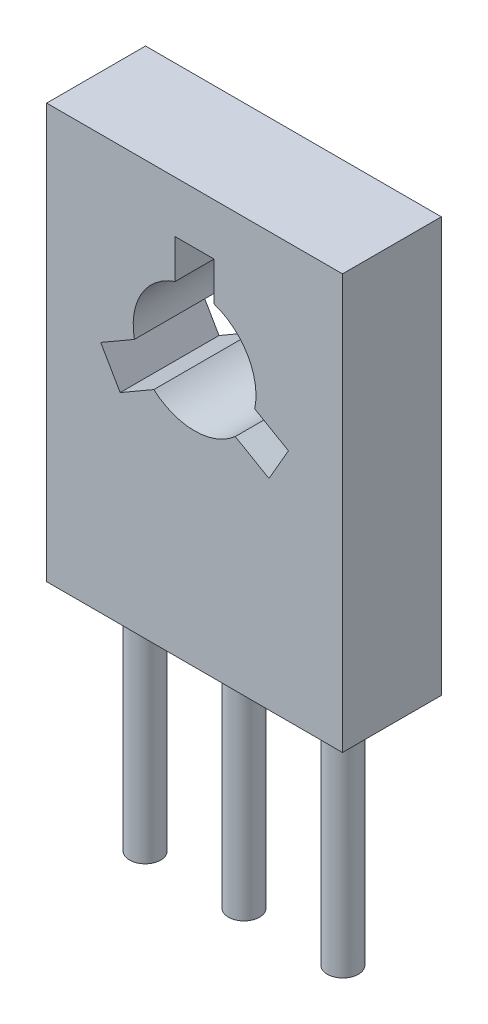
ISO-10303-21;
HEADER;
FILE_DESCRIPTION(('STEP AP214'),'2;1');
FILE_NAME('part.step','',(''),(''),'','','');
FILE_SCHEMA(('AUTOMOTIVE_DESIGN { 1 0 10303 214 1 1 1 1 }'));
ENDSEC;
DATA;
#1=APPLICATION_CONTEXT('core data for automotive mechanical design processes');
#2=APPLICATION_PROTOCOL_DEFINITION('international standard','automotive_design',2000,#1);
#3=PRODUCT_CONTEXT('',#1,'mechanical');
#4=PRODUCT('Part','Part','',(#3));
#5=PRODUCT_RELATED_PRODUCT_CATEGORY('part','',(#4));
#6=PRODUCT_DEFINITION_FORMATION('','',#4);
#7=PRODUCT_DEFINITION_CONTEXT('part definition',#1,'design');
#8=PRODUCT_DEFINITION('design','',#6,#7);
#9=PRODUCT_DEFINITION_SHAPE('','',#8);
#10=(LENGTH_UNIT() NAMED_UNIT(*) SI_UNIT(.MILLI.,.METRE.));
#11=(NAMED_UNIT(*) PLANE_ANGLE_UNIT() SI_UNIT($,.RADIAN.));
#12=(NAMED_UNIT(*) SI_UNIT($,.STERADIAN.) SOLID_ANGLE_UNIT());
#13=UNCERTAINTY_MEASURE_WITH_UNIT(LENGTH_MEASURE(1.E-05),#10,'distance_accuracy_value','');
#14=(GEOMETRIC_REPRESENTATION_CONTEXT(3) GLOBAL_UNCERTAINTY_ASSIGNED_CONTEXT((#13)) GLOBAL_UNIT_ASSIGNED_CONTEXT((#10,
#11,#12)) REPRESENTATION_CONTEXT('',''));
#15=CARTESIAN_POINT('',(0.,0.,0.));
#16=DIRECTION('',(0.,0.,1.));
#17=DIRECTION('',(1.,0.,0.));
#18=AXIS2_PLACEMENT_3D('',#15,#16,#17);
#19=CARTESIAN_POINT('',(-21.9011792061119,5.7776116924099,2.54));
#20=DIRECTION('',(0.,1.,0.));
#21=DIRECTION('',(0.,0.,1.));
#22=AXIS2_PLACEMENT_3D('',#19,#20,#21);
#23=PLANE('',#22);
#24=CARTESIAN_POINT('',(-20.6411792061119,5.7776116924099,1.27));
#25=DIRECTION('',(0.,1.,0.));
#26=DIRECTION('',(0.,0.,1.));
#27=AXIS2_PLACEMENT_3D('',#24,#25,#26);
#28=CIRCLE('',#27,0.400000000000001);
#29=CARTESIAN_POINT('',(-20.6411792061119,5.7776116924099,1.67));
#30=VERTEX_POINT('',#29);
#31=EDGE_CURVE('E35',#30,#30,#28,.F.);
#32=ORIENTED_EDGE('',*,*,#31,.F.);
#33=EDGE_LOOP('',(#32));
#34=FACE_BOUND('',#33,.T.);
#35=DIRECTION('',(1.,0.,0.));
#36=VECTOR('',#35,1.);
#37=CARTESIAN_POINT('',(-21.9011792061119,5.7776116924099,0.));
#38=LINE('',#37,#36);
#39=CARTESIAN_POINT('',(-21.9011792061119,5.7776116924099,0.));
#40=VERTEX_POINT('',#39);
#41=CARTESIAN_POINT('',(-14.3011792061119,5.7776116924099,0.));
#42=VERTEX_POINT('',#41);
#43=EDGE_CURVE('E244',#40,#42,#38,.T.);
#44=ORIENTED_EDGE('',*,*,#43,.T.);
#45=DIRECTION('',(0.,0.,-1.));
#46=VECTOR('',#45,1.);
#47=CARTESIAN_POINT('',(-14.3011792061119,5.7776116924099,2.54));
#48=LINE('',#47,#46);
#49=CARTESIAN_POINT('',(-14.3011792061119,5.7776116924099,2.54));
#50=VERTEX_POINT('',#49);
#51=EDGE_CURVE('E265',#50,#42,#48,.T.);
#52=ORIENTED_EDGE('',*,*,#51,.F.);
#53=DIRECTION('',(1.,0.,0.));
#54=VECTOR('',#53,1.);
#55=CARTESIAN_POINT('',(-21.9011792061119,5.7776116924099,2.54));
#56=LINE('',#55,#54);
#57=CARTESIAN_POINT('',(-21.9011792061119,5.7776116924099,2.54));
#58=VERTEX_POINT('',#57);
#59=EDGE_CURVE('E253',#58,#50,#56,.T.);
#60=ORIENTED_EDGE('',*,*,#59,.F.);
#61=DIRECTION('',(0.,0.,-1.));
#62=VECTOR('',#61,1.);
#63=CARTESIAN_POINT('',(-21.9011792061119,5.7776116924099,2.54));
#64=LINE('',#63,#62);
#65=EDGE_CURVE('E268',#58,#40,#64,.T.);
#66=ORIENTED_EDGE('',*,*,#65,.T.);
#67=EDGE_LOOP('',(#44,#52,#60,#66));
#68=FACE_BOUND('',#67,.T.);
#69=CARTESIAN_POINT('',(-18.1011792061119,5.7776116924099,1.27));
#70=DIRECTION('',(0.,1.,0.));
#71=DIRECTION('',(0.,0.,1.));
#72=AXIS2_PLACEMENT_3D('',#69,#70,#71);
#73=CIRCLE('',#72,0.400000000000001);
#74=CARTESIAN_POINT('',(-18.1011792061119,5.7776116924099,1.67));
#75=VERTEX_POINT('',#74);
#76=EDGE_CURVE('E271',#75,#75,#73,.F.);
#77=ORIENTED_EDGE('',*,*,#76,.F.);
#78=EDGE_LOOP('',(#77));
#79=FACE_BOUND('',#78,.T.);
#80=CARTESIAN_POINT('',(-15.5611792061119,5.7776116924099,1.27));
#81=DIRECTION('',(0.,1.,0.));
#82=DIRECTION('',(0.,0.,1.));
#83=AXIS2_PLACEMENT_3D('',#80,#81,#82);
#84=CIRCLE('',#83,0.399999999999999);
#85=CARTESIAN_POINT('',(-15.5611792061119,5.7776116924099,1.67));
#86=VERTEX_POINT('',#85);
#87=EDGE_CURVE('E11',#86,#86,#84,.F.);
#88=ORIENTED_EDGE('',*,*,#87,.F.);
#89=EDGE_LOOP('',(#88));
#90=FACE_BOUND('',#89,.T.);
#91=ADVANCED_FACE('F27',(#34,#68,#79,#90),#23,.F.);
#92=CARTESIAN_POINT('',(-21.9011792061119,5.7776116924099,2.54));
#93=DIRECTION('',(1.,0.,0.));
#94=DIRECTION('',(0.,0.,-1.));
#95=AXIS2_PLACEMENT_3D('',#92,#93,#94);
#96=PLANE('',#95);
#97=DIRECTION('',(0.,-1.,0.));
#98=VECTOR('',#97,1.);
#99=CARTESIAN_POINT('',(-21.9011792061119,5.7776116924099,0.));
#100=LINE('',#99,#98);
#101=CARTESIAN_POINT('',(-21.9011792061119,16.4276116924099,0.));
#102=VERTEX_POINT('',#101);
#103=EDGE_CURVE('E223',#102,#40,#100,.T.);
#104=ORIENTED_EDGE('',*,*,#103,.T.);
#105=ORIENTED_EDGE('',*,*,#65,.F.);
#106=DIRECTION('',(0.,-1.,0.));
#107=VECTOR('',#106,1.);
#108=CARTESIAN_POINT('',(-21.9011792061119,5.7776116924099,2.54));
#109=LINE('',#108,#107);
#110=CARTESIAN_POINT('',(-21.9011792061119,16.4276116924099,2.54));
#111=VERTEX_POINT('',#110);
#112=EDGE_CURVE('E250',#111,#58,#109,.T.);
#113=ORIENTED_EDGE('',*,*,#112,.F.);
#114=DIRECTION('',(0.,0.,-1.));
#115=VECTOR('',#114,1.);
#116=CARTESIAN_POINT('',(-21.9011792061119,16.4276116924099,2.54));
#117=LINE('',#116,#115);
#118=EDGE_CURVE('E259',#111,#102,#117,.T.);
#119=ORIENTED_EDGE('',*,*,#118,.T.);
#120=EDGE_LOOP('',(#104,#105,#113,#119));
#121=FACE_BOUND('',#120,.T.);
#122=ADVANCED_FACE('F29',(#121),#96,.F.);
#123=CARTESIAN_POINT('',(-14.3011792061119,5.7776116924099,2.54));
#124=DIRECTION('',(-1.,0.,0.));
#125=DIRECTION('',(0.,0.,1.));
#126=AXIS2_PLACEMENT_3D('',#123,#124,#125);
#127=PLANE('',#126);
#128=DIRECTION('',(0.,1.,0.));
#129=VECTOR('',#128,1.);
#130=CARTESIAN_POINT('',(-14.3011792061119,5.7776116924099,0.));
#131=LINE('',#130,#129);
#132=CARTESIAN_POINT('',(-14.3011792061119,16.4276116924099,0.));
#133=VERTEX_POINT('',#132);
#134=EDGE_CURVE('E246',#42,#133,#131,.T.);
#135=ORIENTED_EDGE('',*,*,#134,.T.);
#136=DIRECTION('',(0.,0.,-1.));
#137=VECTOR('',#136,1.);
#138=CARTESIAN_POINT('',(-14.3011792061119,16.4276116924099,2.54));
#139=LINE('',#138,#137);
#140=CARTESIAN_POINT('',(-14.3011792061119,16.4276116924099,2.54));
#141=VERTEX_POINT('',#140);
#142=EDGE_CURVE('E262',#141,#133,#139,.T.);
#143=ORIENTED_EDGE('',*,*,#142,.F.);
#144=DIRECTION('',(0.,1.,0.));
#145=VECTOR('',#144,1.);
#146=CARTESIAN_POINT('',(-14.3011792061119,5.7776116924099,2.54));
#147=LINE('',#146,#145);
#148=EDGE_CURVE('E255',#50,#141,#147,.T.);
#149=ORIENTED_EDGE('',*,*,#148,.F.);
#150=ORIENTED_EDGE('',*,*,#51,.T.);
#151=EDGE_LOOP('',(#135,#143,#149,#150));
#152=FACE_BOUND('',#151,.T.);
#153=ADVANCED_FACE('F365',(#152),#127,.F.);
#154=CARTESIAN_POINT('',(-21.9011792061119,16.4276116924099,2.54));
#155=DIRECTION('',(0.,-1.,0.));
#156=DIRECTION('',(0.,0.,-1.));
#157=AXIS2_PLACEMENT_3D('',#154,#155,#156);
#158=PLANE('',#157);
#159=DIRECTION('',(-1.,0.,0.));
#160=VECTOR('',#159,1.);
#161=CARTESIAN_POINT('',(-21.9011792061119,16.4276116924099,0.));
#162=LINE('',#161,#160);
#163=EDGE_CURVE('E248',#133,#102,#162,.T.);
#164=ORIENTED_EDGE('',*,*,#163,.T.);
#165=ORIENTED_EDGE('',*,*,#118,.F.);
#166=DIRECTION('',(-1.,0.,0.));
#167=VECTOR('',#166,1.);
#168=CARTESIAN_POINT('',(-21.9011792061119,16.4276116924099,2.54));
#169=LINE('',#168,#167);
#170=EDGE_CURVE('E257',#141,#111,#169,.T.);
#171=ORIENTED_EDGE('',*,*,#170,.F.);
#172=ORIENTED_EDGE('',*,*,#142,.T.);
#173=EDGE_LOOP('',(#164,#165,#171,#172));
#174=FACE_BOUND('',#173,.T.);
#175=ADVANCED_FACE('F362',(#174),#158,.F.);
#176=CARTESIAN_POINT('',(-21.9011792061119,16.4276116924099,2.54));
#177=DIRECTION('',(0.,0.,-1.));
#178=DIRECTION('',(-1.,0.,0.));
#179=AXIS2_PLACEMENT_3D('',#176,#177,#178);
#180=PLANE('',#179);
#181=DIRECTION('',(0.866025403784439,-0.499999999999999,0.));
#182=VECTOR('',#181,1.);
#183=CARTESIAN_POINT('',(-16.1894740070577,10.930284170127,2.54));
#184=LINE('',#183,#182);
#185=CARTESIAN_POINT('',(-17.0554994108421,11.430284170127,2.54));
#186=VERTEX_POINT('',#185);
#187=CARTESIAN_POINT('',(-16.1894740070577,10.930284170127,2.54));
#188=VERTEX_POINT('',#187);
#189=EDGE_CURVE('E151',#186,#188,#184,.T.);
#190=ORIENTED_EDGE('',*,*,#189,.F.);
#191=CARTESIAN_POINT('',(-18.1011792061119,12.6113579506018,2.54));
#192=DIRECTION('',(0.,0.,1.));
#193=DIRECTION('',(1.,0.,0.));
#194=AXIS2_PLACEMENT_3D('',#191,#192,#193);
#195=CIRCLE('',#194,1.57746046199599);
#196=CARTESIAN_POINT('',(-19.1468590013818,11.430284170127,2.54));
#197=VERTEX_POINT('',#196);
#198=EDGE_CURVE('E42',#197,#186,#195,.T.);
#199=ORIENTED_EDGE('',*,*,#198,.F.);
#200=DIRECTION('',(0.866025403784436,0.500000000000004,0.));
#201=VECTOR('',#200,1.);
#202=CARTESIAN_POINT('',(-20.0128844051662,10.930284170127,2.54));
#203=LINE('',#202,#201);
#204=CARTESIAN_POINT('',(-20.0128844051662,10.930284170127,2.54));
#205=VERTEX_POINT('',#204);
#206=EDGE_CURVE('E185',#205,#197,#203,.T.);
#207=ORIENTED_EDGE('',*,*,#206,.F.);
#208=DIRECTION('',(0.500000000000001,-0.866025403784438,0.));
#209=VECTOR('',#208,1.);
#210=CARTESIAN_POINT('',(-20.5128844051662,11.7963095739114,2.54));
#211=LINE('',#210,#209);
#212=CARTESIAN_POINT('',(-20.5128844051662,11.7963095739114,2.54));
#213=VERTEX_POINT('',#212);
#214=EDGE_CURVE('E182',#213,#205,#211,.T.);
#215=ORIENTED_EDGE('',*,*,#214,.F.);
#216=DIRECTION('',(-0.866025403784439,-0.5,0.));
#217=VECTOR('',#216,1.);
#218=CARTESIAN_POINT('',(-20.5128844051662,11.7963095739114,2.54));
#219=LINE('',#218,#217);
#220=CARTESIAN_POINT('',(-19.6468590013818,12.2963095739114,2.54));
#221=VERTEX_POINT('',#220);
#222=EDGE_CURVE('E179',#221,#213,#219,.T.);
#223=ORIENTED_EDGE('',*,*,#222,.F.);
#224=CARTESIAN_POINT('',(-18.1011792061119,12.6113579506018,2.54));
#225=DIRECTION('',(0.,0.,1.));
#226=DIRECTION('',(1.,0.,0.));
#227=AXIS2_PLACEMENT_3D('',#224,#225,#226);
#228=CIRCLE('',#227,1.57746046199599);
#229=CARTESIAN_POINT('',(-18.6011792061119,14.107480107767,2.54));
#230=VERTEX_POINT('',#229);
#231=EDGE_CURVE('E176',#230,#221,#228,.T.);
#232=ORIENTED_EDGE('',*,*,#231,.F.);
#233=DIRECTION('',(0.,-1.,0.));
#234=VECTOR('',#233,1.);
#235=CARTESIAN_POINT('',(-18.6011792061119,15.107480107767,2.54));
#236=LINE('',#235,#234);
#237=CARTESIAN_POINT('',(-18.6011792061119,15.107480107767,2.54));
#238=VERTEX_POINT('',#237);
#239=EDGE_CURVE('E173',#238,#230,#236,.T.);
#240=ORIENTED_EDGE('',*,*,#239,.F.);
#241=DIRECTION('',(-1.,0.,0.));
#242=VECTOR('',#241,1.);
#243=CARTESIAN_POINT('',(-18.6011792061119,15.107480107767,2.54));
#244=LINE('',#243,#242);
#245=CARTESIAN_POINT('',(-17.6011792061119,15.107480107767,2.54));
#246=VERTEX_POINT('',#245);
#247=EDGE_CURVE('E170',#246,#238,#244,.T.);
#248=ORIENTED_EDGE('',*,*,#247,.F.);
#249=DIRECTION('',(0.,1.,0.));
#250=VECTOR('',#249,1.);
#251=CARTESIAN_POINT('',(-17.6011792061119,15.107480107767,2.54));
#252=LINE('',#251,#250);
#253=CARTESIAN_POINT('',(-17.6011792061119,14.107480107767,2.54));
#254=VERTEX_POINT('',#253);
#255=EDGE_CURVE('E167',#254,#246,#252,.T.);
#256=ORIENTED_EDGE('',*,*,#255,.F.);
#257=CARTESIAN_POINT('',(-18.1011792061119,12.6113579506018,2.54));
#258=DIRECTION('',(0.,0.,1.));
#259=DIRECTION('',(-1.,0.,0.));
#260=AXIS2_PLACEMENT_3D('',#257,#258,#259);
#261=CIRCLE('',#260,1.57746046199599);
#262=CARTESIAN_POINT('',(-16.5554994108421,12.2963095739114,2.54));
#263=VERTEX_POINT('',#262);
#264=EDGE_CURVE('E161',#263,#254,#261,.T.);
#265=ORIENTED_EDGE('',*,*,#264,.F.);
#266=DIRECTION('',(-0.866025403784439,0.499999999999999,0.));
#267=VECTOR('',#266,1.);
#268=CARTESIAN_POINT('',(-15.6894740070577,11.7963095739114,2.54));
#269=LINE('',#268,#267);
#270=CARTESIAN_POINT('',(-15.6894740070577,11.7963095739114,2.54));
#271=VERTEX_POINT('',#270);
#272=EDGE_CURVE('E159',#271,#263,#269,.T.);
#273=ORIENTED_EDGE('',*,*,#272,.F.);
#274=DIRECTION('',(0.499999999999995,0.866025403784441,0.));
#275=VECTOR('',#274,1.);
#276=CARTESIAN_POINT('',(-16.1894740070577,10.930284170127,2.54));
#277=LINE('',#276,#275);
#278=EDGE_CURVE('E142',#188,#271,#277,.T.);
#279=ORIENTED_EDGE('',*,*,#278,.F.);
#280=EDGE_LOOP('',(#190,#199,#207,#215,#223,#232,#240,#248,#256,#265,#273,#279));
#281=FACE_BOUND('',#280,.T.);
#282=ORIENTED_EDGE('',*,*,#112,.T.);
#283=ORIENTED_EDGE('',*,*,#59,.T.);
#284=ORIENTED_EDGE('',*,*,#148,.T.);
#285=ORIENTED_EDGE('',*,*,#170,.T.);
#286=EDGE_LOOP('',(#282,#283,#284,#285));
#287=FACE_BOUND('',#286,.T.);
#288=ADVANCED_FACE('F155',(#281,#287),#180,.F.);
#289=CARTESIAN_POINT('',(-21.9011792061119,16.4276116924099,0.));
#290=DIRECTION('',(0.,0.,-1.));
#291=DIRECTION('',(-1.,0.,0.));
#292=AXIS2_PLACEMENT_3D('',#289,#290,#291);
#293=PLANE('',#292);
#294=CARTESIAN_POINT('',(-18.1011792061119,12.6113579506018,0.));
#295=DIRECTION('',(0.,0.,1.));
#296=DIRECTION('',(1.,0.,0.));
#297=AXIS2_PLACEMENT_3D('',#294,#295,#296);
#298=CIRCLE('',#297,1.57746046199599);
#299=CARTESIAN_POINT('',(-19.1468590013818,11.430284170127,0.));
#300=VERTEX_POINT('',#299);
#301=CARTESIAN_POINT('',(-17.0554994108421,11.430284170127,0.));
#302=VERTEX_POINT('',#301);
#303=EDGE_CURVE('E188',#300,#302,#298,.T.);
#304=ORIENTED_EDGE('',*,*,#303,.T.);
#305=DIRECTION('',(0.866025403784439,-0.499999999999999,0.));
#306=VECTOR('',#305,1.);
#307=CARTESIAN_POINT('',(-16.1894740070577,10.930284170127,0.));
#308=LINE('',#307,#306);
#309=CARTESIAN_POINT('',(-16.1894740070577,10.930284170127,0.));
#310=VERTEX_POINT('',#309);
#311=EDGE_CURVE('E191',#302,#310,#308,.T.);
#312=ORIENTED_EDGE('',*,*,#311,.T.);
#313=DIRECTION('',(0.499999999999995,0.866025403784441,0.));
#314=VECTOR('',#313,1.);
#315=CARTESIAN_POINT('',(-16.1894740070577,10.930284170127,0.));
#316=LINE('',#315,#314);
#317=CARTESIAN_POINT('',(-15.6894740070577,11.7963095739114,0.));
#318=VERTEX_POINT('',#317);
#319=EDGE_CURVE('E50',#310,#318,#316,.T.);
#320=ORIENTED_EDGE('',*,*,#319,.T.);
#321=DIRECTION('',(-0.866025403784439,0.499999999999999,0.));
#322=VECTOR('',#321,1.);
#323=CARTESIAN_POINT('',(-15.6894740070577,11.7963095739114,0.));
#324=LINE('',#323,#322);
#325=CARTESIAN_POINT('',(-16.5554994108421,12.2963095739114,0.));
#326=VERTEX_POINT('',#325);
#327=EDGE_CURVE('E194',#318,#326,#324,.T.);
#328=ORIENTED_EDGE('',*,*,#327,.T.);
#329=CARTESIAN_POINT('',(-18.1011792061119,12.6113579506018,0.));
#330=DIRECTION('',(0.,0.,1.));
#331=DIRECTION('',(-1.,0.,0.));
#332=AXIS2_PLACEMENT_3D('',#329,#330,#331);
#333=CIRCLE('',#332,1.57746046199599);
#334=CARTESIAN_POINT('',(-17.6011792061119,14.107480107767,0.));
#335=VERTEX_POINT('',#334);
#336=EDGE_CURVE('E197',#326,#335,#333,.T.);
#337=ORIENTED_EDGE('',*,*,#336,.T.);
#338=DIRECTION('',(0.,1.,0.));
#339=VECTOR('',#338,1.);
#340=CARTESIAN_POINT('',(-17.6011792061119,15.107480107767,0.));
#341=LINE('',#340,#339);
#342=CARTESIAN_POINT('',(-17.6011792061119,15.107480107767,0.));
#343=VERTEX_POINT('',#342);
#344=EDGE_CURVE('E200',#335,#343,#341,.T.);
#345=ORIENTED_EDGE('',*,*,#344,.T.);
#346=DIRECTION('',(-1.,0.,0.));
#347=VECTOR('',#346,1.);
#348=CARTESIAN_POINT('',(-18.6011792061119,15.107480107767,0.));
#349=LINE('',#348,#347);
#350=CARTESIAN_POINT('',(-18.6011792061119,15.107480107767,0.));
#351=VERTEX_POINT('',#350);
#352=EDGE_CURVE('E203',#343,#351,#349,.T.);
#353=ORIENTED_EDGE('',*,*,#352,.T.);
#354=DIRECTION('',(0.,-1.,0.));
#355=VECTOR('',#354,1.);
#356=CARTESIAN_POINT('',(-18.6011792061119,15.107480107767,0.));
#357=LINE('',#356,#355);
#358=CARTESIAN_POINT('',(-18.6011792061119,14.107480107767,0.));
#359=VERTEX_POINT('',#358);
#360=EDGE_CURVE('E206',#351,#359,#357,.T.);
#361=ORIENTED_EDGE('',*,*,#360,.T.);
#362=CARTESIAN_POINT('',(-18.1011792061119,12.6113579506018,0.));
#363=DIRECTION('',(0.,0.,1.));
#364=DIRECTION('',(1.,0.,0.));
#365=AXIS2_PLACEMENT_3D('',#362,#363,#364);
#366=CIRCLE('',#365,1.57746046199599);
#367=CARTESIAN_POINT('',(-19.6468590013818,12.2963095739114,0.));
#368=VERTEX_POINT('',#367);
#369=EDGE_CURVE('E209',#359,#368,#366,.T.);
#370=ORIENTED_EDGE('',*,*,#369,.T.);
#371=DIRECTION('',(-0.866025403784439,-0.5,0.));
#372=VECTOR('',#371,1.);
#373=CARTESIAN_POINT('',(-20.5128844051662,11.7963095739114,0.));
#374=LINE('',#373,#372);
#375=CARTESIAN_POINT('',(-20.5128844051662,11.7963095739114,0.));
#376=VERTEX_POINT('',#375);
#377=EDGE_CURVE('E212',#368,#376,#374,.T.);
#378=ORIENTED_EDGE('',*,*,#377,.T.);
#379=DIRECTION('',(0.500000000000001,-0.866025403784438,0.));
#380=VECTOR('',#379,1.);
#381=CARTESIAN_POINT('',(-20.5128844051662,11.7963095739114,0.));
#382=LINE('',#381,#380);
#383=CARTESIAN_POINT('',(-20.0128844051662,10.930284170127,0.));
#384=VERTEX_POINT('',#383);
#385=EDGE_CURVE('E215',#376,#384,#382,.T.);
#386=ORIENTED_EDGE('',*,*,#385,.T.);
#387=DIRECTION('',(0.866025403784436,0.500000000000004,0.));
#388=VECTOR('',#387,1.);
#389=CARTESIAN_POINT('',(-20.0128844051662,10.930284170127,0.));
#390=LINE('',#389,#388);
#391=EDGE_CURVE('E218',#384,#300,#390,.T.);
#392=ORIENTED_EDGE('',*,*,#391,.T.);
#393=EDGE_LOOP('',(#304,#312,#320,#328,#337,#345,#353,#361,#370,#378,#386,#392));
#394=FACE_BOUND('',#393,.T.);
#395=ORIENTED_EDGE('',*,*,#103,.F.);
#396=ORIENTED_EDGE('',*,*,#163,.F.);
#397=ORIENTED_EDGE('',*,*,#134,.F.);
#398=ORIENTED_EDGE('',*,*,#43,.F.);
#399=EDGE_LOOP('',(#395,#396,#397,#398));
#400=FACE_BOUND('',#399,.T.);
#401=ADVANCED_FACE('F356',(#394,#400),#293,.T.);
#402=CARTESIAN_POINT('',(-18.1011792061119,12.6113579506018,0.));
#403=DIRECTION('',(0.,0.,1.));
#404=DIRECTION('',(1.,0.,0.));
#405=AXIS2_PLACEMENT_3D('',#402,#403,#404);
#406=CYLINDRICAL_SURFACE('',#405,1.57746046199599);
#407=ORIENTED_EDGE('',*,*,#198,.T.);
#408=DIRECTION('',(0.,0.,1.));
#409=VECTOR('',#408,1.);
#410=CARTESIAN_POINT('',(-17.0554994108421,11.430284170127,0.));
#411=LINE('',#410,#409);
#412=EDGE_CURVE('E148',#302,#186,#411,.T.);
#413=ORIENTED_EDGE('',*,*,#412,.F.);
#414=ORIENTED_EDGE('',*,*,#303,.F.);
#415=DIRECTION('',(0.,0.,1.));
#416=VECTOR('',#415,1.);
#417=CARTESIAN_POINT('',(-19.1468590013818,11.430284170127,0.));
#418=LINE('',#417,#416);
#419=EDGE_CURVE('E221',#300,#197,#418,.T.);
#420=ORIENTED_EDGE('',*,*,#419,.T.);
#421=EDGE_LOOP('',(#407,#413,#414,#420));
#422=FACE_BOUND('',#421,.T.);
#423=ADVANCED_FACE('F317',(#422),#406,.F.);
#424=CARTESIAN_POINT('',(-20.0128844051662,10.930284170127,0.));
#425=DIRECTION('',(0.500000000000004,-0.866025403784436,0.));
#426=DIRECTION('',(0.866025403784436,0.500000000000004,0.));
#427=AXIS2_PLACEMENT_3D('',#424,#425,#426);
#428=PLANE('',#427);
#429=ORIENTED_EDGE('',*,*,#206,.T.);
#430=ORIENTED_EDGE('',*,*,#419,.F.);
#431=ORIENTED_EDGE('',*,*,#391,.F.);
#432=DIRECTION('',(0.,0.,1.));
#433=VECTOR('',#432,1.);
#434=CARTESIAN_POINT('',(-20.0128844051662,10.930284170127,0.));
#435=LINE('',#434,#433);
#436=EDGE_CURVE('E224',#384,#205,#435,.T.);
#437=ORIENTED_EDGE('',*,*,#436,.T.);
#438=EDGE_LOOP('',(#429,#430,#431,#437));
#439=FACE_BOUND('',#438,.T.);
#440=ADVANCED_FACE('F313',(#439),#428,.F.);
#441=CARTESIAN_POINT('',(-20.5128844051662,11.7963095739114,0.));
#442=DIRECTION('',(-0.866025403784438,-0.500000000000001,0.));
#443=DIRECTION('',(0.500000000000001,-0.866025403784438,0.));
#444=AXIS2_PLACEMENT_3D('',#441,#442,#443);
#445=PLANE('',#444);
#446=ORIENTED_EDGE('',*,*,#214,.T.);
#447=ORIENTED_EDGE('',*,*,#436,.F.);
#448=ORIENTED_EDGE('',*,*,#385,.F.);
#449=DIRECTION('',(0.,0.,1.));
#450=VECTOR('',#449,1.);
#451=CARTESIAN_POINT('',(-20.5128844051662,11.7963095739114,0.));
#452=LINE('',#451,#450);
#453=EDGE_CURVE('E226',#376,#213,#452,.T.);
#454=ORIENTED_EDGE('',*,*,#453,.T.);
#455=EDGE_LOOP('',(#446,#447,#448,#454));
#456=FACE_BOUND('',#455,.T.);
#457=ADVANCED_FACE('F316',(#456),#445,.F.);
#458=CARTESIAN_POINT('',(-20.5128844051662,11.7963095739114,0.));
#459=DIRECTION('',(-0.5,0.866025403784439,0.));
#460=DIRECTION('',(-0.866025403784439,-0.5,0.));
#461=AXIS2_PLACEMENT_3D('',#458,#459,#460);
#462=PLANE('',#461);
#463=ORIENTED_EDGE('',*,*,#222,.T.);
#464=ORIENTED_EDGE('',*,*,#453,.F.);
#465=ORIENTED_EDGE('',*,*,#377,.F.);
#466=DIRECTION('',(0.,0.,1.));
#467=VECTOR('',#466,1.);
#468=CARTESIAN_POINT('',(-19.6468590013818,12.2963095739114,0.));
#469=LINE('',#468,#467);
#470=EDGE_CURVE('E228',#368,#221,#469,.T.);
#471=ORIENTED_EDGE('',*,*,#470,.T.);
#472=EDGE_LOOP('',(#463,#464,#465,#471));
#473=FACE_BOUND('',#472,.T.);
#474=ADVANCED_FACE('F321',(#473),#462,.F.);
#475=CARTESIAN_POINT('',(-18.1011792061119,12.6113579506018,0.));
#476=DIRECTION('',(0.,0.,1.));
#477=DIRECTION('',(1.,0.,0.));
#478=AXIS2_PLACEMENT_3D('',#475,#476,#477);
#479=CYLINDRICAL_SURFACE('',#478,1.57746046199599);
#480=ORIENTED_EDGE('',*,*,#231,.T.);
#481=ORIENTED_EDGE('',*,*,#470,.F.);
#482=ORIENTED_EDGE('',*,*,#369,.F.);
#483=DIRECTION('',(0.,0.,1.));
#484=VECTOR('',#483,1.);
#485=CARTESIAN_POINT('',(-18.6011792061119,14.107480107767,0.));
#486=LINE('',#485,#484);
#487=EDGE_CURVE('E230',#359,#230,#486,.T.);
#488=ORIENTED_EDGE('',*,*,#487,.T.);
#489=EDGE_LOOP('',(#480,#481,#482,#488));
#490=FACE_BOUND('',#489,.T.);
#491=ADVANCED_FACE('F325',(#490),#479,.F.);
#492=CARTESIAN_POINT('',(-18.6011792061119,15.107480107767,0.));
#493=DIRECTION('',(-1.,0.,0.));
#494=DIRECTION('',(0.,-1.,0.));
#495=AXIS2_PLACEMENT_3D('',#492,#493,#494);
#496=PLANE('',#495);
#497=ORIENTED_EDGE('',*,*,#239,.T.);
#498=ORIENTED_EDGE('',*,*,#487,.F.);
#499=ORIENTED_EDGE('',*,*,#360,.F.);
#500=DIRECTION('',(0.,0.,1.));
#501=VECTOR('',#500,1.);
#502=CARTESIAN_POINT('',(-18.6011792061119,15.107480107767,0.));
#503=LINE('',#502,#501);
#504=EDGE_CURVE('E232',#351,#238,#503,.T.);
#505=ORIENTED_EDGE('',*,*,#504,.T.);
#506=EDGE_LOOP('',(#497,#498,#499,#505));
#507=FACE_BOUND('',#506,.T.);
#508=ADVANCED_FACE('F329',(#507),#496,.F.);
#509=CARTESIAN_POINT('',(-18.6011792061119,15.107480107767,0.));
#510=DIRECTION('',(0.,1.,0.));
#511=DIRECTION('',(0.,0.,1.));
#512=AXIS2_PLACEMENT_3D('',#509,#510,#511);
#513=PLANE('',#512);
#514=ORIENTED_EDGE('',*,*,#247,.T.);
#515=ORIENTED_EDGE('',*,*,#504,.F.);
#516=ORIENTED_EDGE('',*,*,#352,.F.);
#517=DIRECTION('',(0.,0.,1.));
#518=VECTOR('',#517,1.);
#519=CARTESIAN_POINT('',(-17.6011792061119,15.107480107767,0.));
#520=LINE('',#519,#518);
#521=EDGE_CURVE('E234',#343,#246,#520,.T.);
#522=ORIENTED_EDGE('',*,*,#521,.T.);
#523=EDGE_LOOP('',(#514,#515,#516,#522));
#524=FACE_BOUND('',#523,.T.);
#525=ADVANCED_FACE('F333',(#524),#513,.F.);
#526=CARTESIAN_POINT('',(-17.6011792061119,15.107480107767,0.));
#527=DIRECTION('',(1.,0.,0.));
#528=DIRECTION('',(0.,1.,0.));
#529=AXIS2_PLACEMENT_3D('',#526,#527,#528);
#530=PLANE('',#529);
#531=ORIENTED_EDGE('',*,*,#255,.T.);
#532=ORIENTED_EDGE('',*,*,#521,.F.);
#533=ORIENTED_EDGE('',*,*,#344,.F.);
#534=DIRECTION('',(0.,0.,1.));
#535=VECTOR('',#534,1.);
#536=CARTESIAN_POINT('',(-17.6011792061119,14.107480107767,0.));
#537=LINE('',#536,#535);
#538=EDGE_CURVE('E236',#335,#254,#537,.T.);
#539=ORIENTED_EDGE('',*,*,#538,.T.);
#540=EDGE_LOOP('',(#531,#532,#533,#539));
#541=FACE_BOUND('',#540,.T.);
#542=ADVANCED_FACE('F337',(#541),#530,.F.);
#543=CARTESIAN_POINT('',(-18.1011792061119,12.6113579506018,0.));
#544=DIRECTION('',(0.,0.,1.));
#545=DIRECTION('',(1.,0.,0.));
#546=AXIS2_PLACEMENT_3D('',#543,#544,#545);
#547=CYLINDRICAL_SURFACE('',#546,1.57746046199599);
#548=ORIENTED_EDGE('',*,*,#264,.T.);
#549=ORIENTED_EDGE('',*,*,#538,.F.);
#550=ORIENTED_EDGE('',*,*,#336,.F.);
#551=DIRECTION('',(0.,0.,1.));
#552=VECTOR('',#551,1.);
#553=CARTESIAN_POINT('',(-16.5554994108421,12.2963095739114,0.));
#554=LINE('',#553,#552);
#555=EDGE_CURVE('E238',#326,#263,#554,.T.);
#556=ORIENTED_EDGE('',*,*,#555,.T.);
#557=EDGE_LOOP('',(#548,#549,#550,#556));
#558=FACE_BOUND('',#557,.T.);
#559=ADVANCED_FACE('F341',(#558),#547,.F.);
#560=CARTESIAN_POINT('',(-15.6894740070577,11.7963095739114,0.));
#561=DIRECTION('',(0.499999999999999,0.866025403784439,0.));
#562=DIRECTION('',(-0.866025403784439,0.499999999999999,0.));
#563=AXIS2_PLACEMENT_3D('',#560,#561,#562);
#564=PLANE('',#563);
#565=ORIENTED_EDGE('',*,*,#272,.T.);
#566=ORIENTED_EDGE('',*,*,#555,.F.);
#567=ORIENTED_EDGE('',*,*,#327,.F.);
#568=DIRECTION('',(0.,0.,1.));
#569=VECTOR('',#568,1.);
#570=CARTESIAN_POINT('',(-15.6894740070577,11.7963095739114,0.));
#571=LINE('',#570,#569);
#572=EDGE_CURVE('E147',#318,#271,#571,.T.);
#573=ORIENTED_EDGE('',*,*,#572,.T.);
#574=EDGE_LOOP('',(#565,#566,#567,#573));
#575=FACE_BOUND('',#574,.T.);
#576=ADVANCED_FACE('F345',(#575),#564,.F.);
#577=CARTESIAN_POINT('',(-16.1894740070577,10.930284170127,0.));
#578=DIRECTION('',(0.866025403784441,-0.499999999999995,0.));
#579=DIRECTION('',(0.499999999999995,0.866025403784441,0.));
#580=AXIS2_PLACEMENT_3D('',#577,#578,#579);
#581=PLANE('',#580);
#582=ORIENTED_EDGE('',*,*,#278,.T.);
#583=ORIENTED_EDGE('',*,*,#572,.F.);
#584=ORIENTED_EDGE('',*,*,#319,.F.);
#585=DIRECTION('',(0.,0.,1.));
#586=VECTOR('',#585,1.);
#587=CARTESIAN_POINT('',(-16.1894740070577,10.930284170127,0.));
#588=LINE('',#587,#586);
#589=EDGE_CURVE('E138',#310,#188,#588,.T.);
#590=ORIENTED_EDGE('',*,*,#589,.T.);
#591=EDGE_LOOP('',(#582,#583,#584,#590));
#592=FACE_BOUND('',#591,.T.);
#593=ADVANCED_FACE('F140',(#592),#581,.F.);
#594=CARTESIAN_POINT('',(-16.1894740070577,10.930284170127,0.));
#595=DIRECTION('',(-0.499999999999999,-0.866025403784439,0.));
#596=DIRECTION('',(0.866025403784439,-0.499999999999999,0.));
#597=AXIS2_PLACEMENT_3D('',#594,#595,#596);
#598=PLANE('',#597);
#599=ORIENTED_EDGE('',*,*,#189,.T.);
#600=ORIENTED_EDGE('',*,*,#589,.F.);
#601=ORIENTED_EDGE('',*,*,#311,.F.);
#602=ORIENTED_EDGE('',*,*,#412,.T.);
#603=EDGE_LOOP('',(#599,#600,#601,#602));
#604=FACE_BOUND('',#603,.T.);
#605=ADVANCED_FACE('F152',(#604),#598,.F.);
#606=CARTESIAN_POINT('',(-18.1011792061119,-0.222388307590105,1.27));
#607=DIRECTION('',(0.,1.,0.));
#608=DIRECTION('',(0.,0.,1.));
#609=AXIS2_PLACEMENT_3D('',#606,#607,#608);
#610=CYLINDRICAL_SURFACE('',#609,0.400000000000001);
#611=CARTESIAN_POINT('',(-18.1011792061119,-0.222388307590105,1.27));
#612=DIRECTION('',(0.,-1.,0.));
#613=DIRECTION('',(0.,0.,-1.));
#614=AXIS2_PLACEMENT_3D('',#611,#612,#613);
#615=CIRCLE('',#614,0.400000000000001);
#616=CARTESIAN_POINT('',(-18.1011792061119,-0.222388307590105,0.869999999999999));
#617=VERTEX_POINT('',#616);
#618=EDGE_CURVE('E479',#617,#617,#615,.T.);
#619=ORIENTED_EDGE('',*,*,#618,.F.);
#620=EDGE_LOOP('',(#619));
#621=FACE_BOUND('',#620,.T.);
#622=ORIENTED_EDGE('',*,*,#76,.T.);
#623=EDGE_LOOP('',(#622));
#624=FACE_BOUND('',#623,.T.);
#625=ADVANCED_FACE('F308',(#621,#624),#610,.T.);
#626=CARTESIAN_POINT('',(-18.1011792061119,-0.222388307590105,1.27));
#627=DIRECTION('',(0.,-1.,0.));
#628=DIRECTION('',(0.,0.,-1.));
#629=AXIS2_PLACEMENT_3D('',#626,#627,#628);
#630=PLANE('',#629);
#631=ORIENTED_EDGE('',*,*,#618,.T.);
#632=EDGE_LOOP('',(#631));
#633=FACE_BOUND('',#632,.T.);
#634=ADVANCED_FACE('F304',(#633),#630,.T.);
#635=CARTESIAN_POINT('',(-20.6411792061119,-0.222388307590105,1.27));
#636=DIRECTION('',(0.,1.,0.));
#637=DIRECTION('',(0.,0.,1.));
#638=AXIS2_PLACEMENT_3D('',#635,#636,#637);
#639=CYLINDRICAL_SURFACE('',#638,0.400000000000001);
#640=CARTESIAN_POINT('',(-20.6411792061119,-0.222388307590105,1.27));
#641=DIRECTION('',(0.,-1.,0.));
#642=DIRECTION('',(0.,0.,-1.));
#643=AXIS2_PLACEMENT_3D('',#640,#641,#642);
#644=CIRCLE('',#643,0.400000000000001);
#645=CARTESIAN_POINT('',(-20.6411792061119,-0.222388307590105,0.869999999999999));
#646=VERTEX_POINT('',#645);
#647=EDGE_CURVE('E481',#646,#646,#644,.T.);
#648=ORIENTED_EDGE('',*,*,#647,.F.);
#649=EDGE_LOOP('',(#648));
#650=FACE_BOUND('',#649,.T.);
#651=ORIENTED_EDGE('',*,*,#31,.T.);
#652=EDGE_LOOP('',(#651));
#653=FACE_BOUND('',#652,.T.);
#654=ADVANCED_FACE('F276',(#650,#653),#639,.T.);
#655=CARTESIAN_POINT('',(-20.6411792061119,-0.222388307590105,1.27));
#656=DIRECTION('',(0.,-1.,0.));
#657=DIRECTION('',(0.,0.,-1.));
#658=AXIS2_PLACEMENT_3D('',#655,#656,#657);
#659=PLANE('',#658);
#660=ORIENTED_EDGE('',*,*,#647,.T.);
#661=EDGE_LOOP('',(#660));
#662=FACE_BOUND('',#661,.T.);
#663=ADVANCED_FACE('F289',(#662),#659,.T.);
#664=CARTESIAN_POINT('',(-15.5611792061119,-0.222388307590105,1.27));
#665=DIRECTION('',(0.,1.,0.));
#666=DIRECTION('',(0.,0.,1.));
#667=AXIS2_PLACEMENT_3D('',#664,#665,#666);
#668=CYLINDRICAL_SURFACE('',#667,0.399999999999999);
#669=CARTESIAN_POINT('',(-15.5611792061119,-0.222388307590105,1.27));
#670=DIRECTION('',(0.,-1.,0.));
#671=DIRECTION('',(0.,0.,-1.));
#672=AXIS2_PLACEMENT_3D('',#669,#670,#671);
#673=CIRCLE('',#672,0.399999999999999);
#674=CARTESIAN_POINT('',(-15.5611792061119,-0.222388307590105,0.870000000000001));
#675=VERTEX_POINT('',#674);
#676=EDGE_CURVE('E486',#675,#675,#673,.T.);
#677=ORIENTED_EDGE('',*,*,#676,.F.);
#678=EDGE_LOOP('',(#677));
#679=FACE_BOUND('',#678,.T.);
#680=ORIENTED_EDGE('',*,*,#87,.T.);
#681=EDGE_LOOP('',(#680));
#682=FACE_BOUND('',#681,.T.);
#683=ADVANCED_FACE('F286',(#679,#682),#668,.T.);
#684=CARTESIAN_POINT('',(-15.5611792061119,-0.222388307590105,1.27));
#685=DIRECTION('',(0.,-1.,0.));
#686=DIRECTION('',(0.,0.,-1.));
#687=AXIS2_PLACEMENT_3D('',#684,#685,#686);
#688=PLANE('',#687);
#689=ORIENTED_EDGE('',*,*,#676,.T.);
#690=EDGE_LOOP('',(#689));
#691=FACE_BOUND('',#690,.T.);
#692=ADVANCED_FACE('F288',(#691),#688,.T.);
#693=CLOSED_SHELL('',(#91,#122,#153,#175,#288,#401,#423,#440,#457,#474,#491,#508,#525,#542,#559,
#576,#593,#605,#625,#634,#654,#663,#683,#692));
#694=MANIFOLD_SOLID_BREP('B2',#693);
#695=ADVANCED_BREP_SHAPE_REPRESENTATION('',(#18,#694),#14);
#696=SHAPE_DEFINITION_REPRESENTATION(#9,#695);
ENDSEC;
END-ISO-10303-21;
